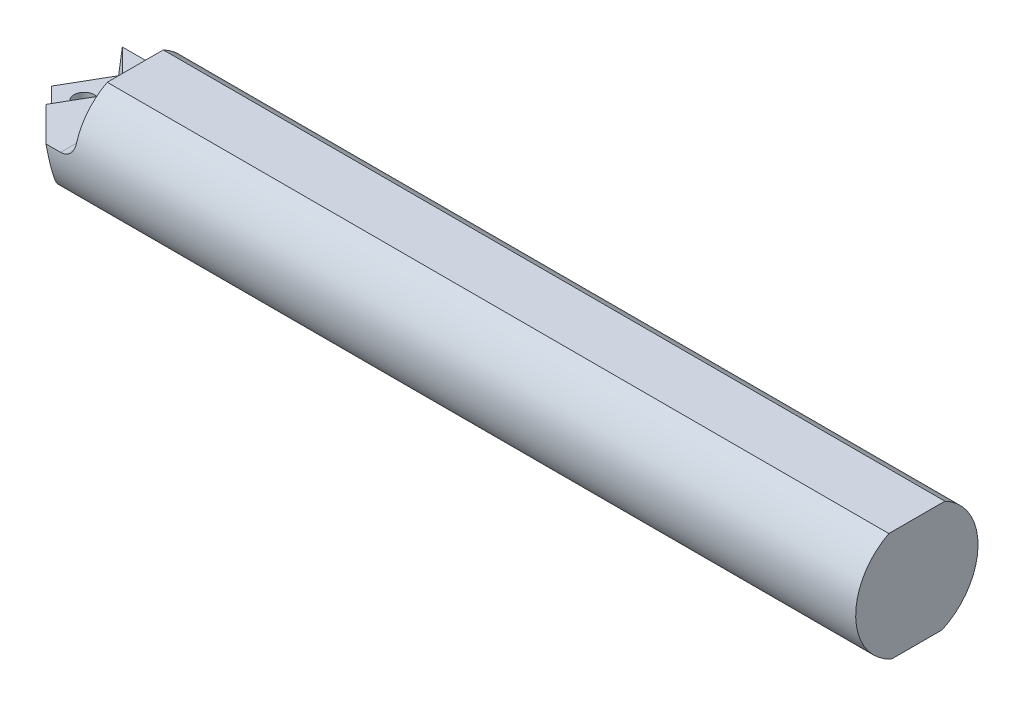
ISO-10303-21;
HEADER;
FILE_DESCRIPTION(('STEP AP214'),'2;1');
FILE_NAME('part.step','',(''),(''),'','','');
FILE_SCHEMA(('AUTOMOTIVE_DESIGN { 1 0 10303 214 1 1 1 1 }'));
ENDSEC;
DATA;
#1=APPLICATION_CONTEXT('core data for automotive mechanical design processes');
#2=APPLICATION_PROTOCOL_DEFINITION('international standard','automotive_design',2000,#1);
#3=PRODUCT_CONTEXT('',#1,'mechanical');
#4=PRODUCT('Part','Part','',(#3));
#5=PRODUCT_RELATED_PRODUCT_CATEGORY('part','',(#4));
#6=PRODUCT_DEFINITION_FORMATION('','',#4);
#7=PRODUCT_DEFINITION_CONTEXT('part definition',#1,'design');
#8=PRODUCT_DEFINITION('design','',#6,#7);
#9=PRODUCT_DEFINITION_SHAPE('','',#8);
#10=(LENGTH_UNIT() NAMED_UNIT(*) SI_UNIT(.MILLI.,.METRE.));
#11=(NAMED_UNIT(*) PLANE_ANGLE_UNIT() SI_UNIT($,.RADIAN.));
#12=(NAMED_UNIT(*) SI_UNIT($,.STERADIAN.) SOLID_ANGLE_UNIT());
#13=UNCERTAINTY_MEASURE_WITH_UNIT(LENGTH_MEASURE(1.E-05),#10,'distance_accuracy_value','');
#14=(GEOMETRIC_REPRESENTATION_CONTEXT(3) GLOBAL_UNCERTAINTY_ASSIGNED_CONTEXT((#13)) GLOBAL_UNIT_ASSIGNED_CONTEXT((#10,
#11,#12)) REPRESENTATION_CONTEXT('',''));
#15=CARTESIAN_POINT('',(0.,0.,0.));
#16=DIRECTION('',(0.,0.,1.));
#17=DIRECTION('',(1.,0.,0.));
#18=AXIS2_PLACEMENT_3D('',#15,#16,#17);
#19=CARTESIAN_POINT('',(65.,0.,0.));
#20=DIRECTION('',(-1.,0.,0.));
#21=DIRECTION('',(0.,0.,1.));
#22=AXIS2_PLACEMENT_3D('',#19,#20,#21);
#23=CYLINDRICAL_SURFACE('',#22,9.);
#24=CARTESIAN_POINT('',(-50.,0.,0.));
#25=DIRECTION('',(-1.,0.,0.));
#26=DIRECTION('',(0.,0.,1.));
#27=AXIS2_PLACEMENT_3D('',#24,#25,#26);
#28=CIRCLE('',#27,9.);
#29=CARTESIAN_POINT('',(-50.,2.5,8.64580823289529));
#30=VERTEX_POINT('',#29);
#31=CARTESIAN_POINT('',(-50.,8.,4.12310562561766));
#32=VERTEX_POINT('',#31);
#33=EDGE_CURVE('E171',#30,#32,#28,.T.);
#34=ORIENTED_EDGE('',*,*,#33,.F.);
#35=CARTESIAN_POINT('',(-50.,2.5,8.64580823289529));
#36=CARTESIAN_POINT('',(-50.000000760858,2.44518629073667,8.6616608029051));
#37=CARTESIAN_POINT('',(-50.0022551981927,2.39024129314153,8.67698015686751));
#38=CARTESIAN_POINT('',(-50.0113263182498,2.28041439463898,8.70648829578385));
#39=CARTESIAN_POINT('',(-50.0181438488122,2.22553250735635,8.7206768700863));
#40=CARTESIAN_POINT('',(-50.0455083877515,2.06158373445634,8.76142104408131));
#41=CARTESIAN_POINT('',(-50.0729671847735,1.95312970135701,8.78617930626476));
#42=CARTESIAN_POINT('',(-50.14610174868,1.74128217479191,8.83061157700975));
#43=CARTESIAN_POINT('',(-50.191807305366,1.63789726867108,8.85027718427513));
#44=CARTESIAN_POINT('',(-50.3004076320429,1.43974897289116,8.88466272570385));
#45=CARTESIAN_POINT('',(-50.3632909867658,1.34497991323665,8.89938592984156));
#46=CARTESIAN_POINT('',(-50.5028939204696,1.16921847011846,8.92416056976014));
#47=CARTESIAN_POINT('',(-50.5792563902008,1.08795621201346,8.93431300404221));
#48=CARTESIAN_POINT('',(-50.7446581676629,0.939071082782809,8.95118839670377));
#49=CARTESIAN_POINT('',(-50.833701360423,0.871452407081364,8.95791030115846));
#50=CARTESIAN_POINT('',(-51.0216293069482,0.752100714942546,8.96872003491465));
#51=CARTESIAN_POINT('',(-51.1204849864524,0.700322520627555,8.97281539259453));
#52=CARTESIAN_POINT('',(-51.3254535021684,0.61390851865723,8.97914262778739));
#53=CARTESIAN_POINT('',(-51.4315626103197,0.579263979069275,8.98137545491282));
#54=CARTESIAN_POINT('',(-51.6151426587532,0.535847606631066,8.98405199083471));
#55=CARTESIAN_POINT('',(-51.6915410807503,0.522415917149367,8.98483290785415));
#56=CARTESIAN_POINT('',(-51.8452830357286,0.504491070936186,8.9858505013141));
#57=CARTESIAN_POINT('',(-51.9226252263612,0.49998643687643,8.98608787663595));
#58=CARTESIAN_POINT('',(-52.,0.500000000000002,8.98610037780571));
#59=B_SPLINE_CURVE_WITH_KNOTS('',3,(#35,#36,#37,#38,#39,#40,#41,#42,#43,#44,#45,#46,#47,#48,#49,
#50,#51,#52,#53,#54,#55,#56,#57,#58),.UNSPECIFIED.,.F.,.F.,(4,2,2,2,2,2,2,2,2,2,2,4),(0.,
0.171085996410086,0.3422037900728,0.684180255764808,1.02671733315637,1.3690273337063,
1.70334953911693,2.03777439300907,2.37123636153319,2.70452821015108,2.93675687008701,
3.16868676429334),.UNSPECIFIED.);
#60=CARTESIAN_POINT('',(-52.,0.500000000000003,8.98610037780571));
#61=VERTEX_POINT('',#60);
#62=EDGE_CURVE('E53',#30,#61,#59,.T.);
#63=ORIENTED_EDGE('',*,*,#62,.T.);
#64=DIRECTION('',(-1.,0.,0.));
#65=VECTOR('',#64,1.);
#66=CARTESIAN_POINT('',(65.,0.500000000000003,8.98610037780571));
#67=LINE('',#66,#65);
#68=CARTESIAN_POINT('',(-54.1466084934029,0.500000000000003,8.98610037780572));
#69=VERTEX_POINT('',#68);
#70=EDGE_CURVE('E181',#61,#69,#67,.T.);
#71=ORIENTED_EDGE('',*,*,#70,.T.);
#72=CARTESIAN_POINT('',(-63.0080268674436,0.,0.));
#73=DIRECTION('',(0.696364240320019,0.173648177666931,-0.696364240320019));
#74=DIRECTION('',(-0.717688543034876,0.168488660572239,-0.675673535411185));
#75=AXIS2_PLACEMENT_3D('',#72,#73,#74);
#76=ELLIPSE('',#75,12.9242707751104,9.);
#77=CARTESIAN_POINT('',(-57.2537946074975,-8.2,3.70944739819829));
#78=VERTEX_POINT('',#77);
#79=EDGE_CURVE('E315',#69,#78,#76,.T.);
#80=ORIENTED_EDGE('',*,*,#79,.T.);
#81=DIRECTION('',(-1.,0.,0.));
#82=VECTOR('',#81,1.);
#83=CARTESIAN_POINT('',(65.,-8.2,3.70944739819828));
#84=LINE('',#83,#82);
#85=CARTESIAN_POINT('',(65.,-8.2,3.70944739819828));
#86=VERTEX_POINT('',#85);
#87=EDGE_CURVE('E312',#86,#78,#84,.T.);
#88=ORIENTED_EDGE('',*,*,#87,.F.);
#89=CARTESIAN_POINT('',(65.,0.,0.));
#90=DIRECTION('',(1.,0.,0.));
#91=DIRECTION('',(0.,0.,-1.));
#92=AXIS2_PLACEMENT_3D('',#89,#90,#91);
#93=CIRCLE('',#92,9.);
#94=CARTESIAN_POINT('',(65.,8.,4.12310562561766));
#95=VERTEX_POINT('',#94);
#96=EDGE_CURVE('E196',#95,#86,#93,.T.);
#97=ORIENTED_EDGE('',*,*,#96,.F.);
#98=DIRECTION('',(-1.,0.,0.));
#99=VECTOR('',#98,1.);
#100=CARTESIAN_POINT('',(65.,8.,4.12310562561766));
#101=LINE('',#100,#99);
#102=EDGE_CURVE('E188',#32,#95,#101,.F.);
#103=ORIENTED_EDGE('',*,*,#102,.F.);
#104=EDGE_LOOP('',(#34,#63,#71,#80,#88,#97,#103));
#105=FACE_BOUND('',#104,.T.);
#106=ADVANCED_FACE('F39',(#105),#23,.T.);
#107=DIRECTION('',(-1.,0.,0.));
#108=VECTOR('',#107,1.);
#109=CARTESIAN_POINT('',(65.,-8.2,-3.70944739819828));
#110=LINE('',#109,#108);
#111=CARTESIAN_POINT('',(-62.1650683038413,-8.2,-3.70944739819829));
#112=VERTEX_POINT('',#111);
#113=CARTESIAN_POINT('',(-60.9532266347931,-8.2,-3.70944739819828));
#114=VERTEX_POINT('',#113);
#115=EDGE_CURVE('E350',#112,#114,#110,.F.);
#116=ORIENTED_EDGE('',*,*,#115,.F.);
#117=CARTESIAN_POINT('',(-65.9762786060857,0.,0.));
#118=DIRECTION('',(0.852868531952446,0.173648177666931,0.492403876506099));
#119=DIRECTION('',(-0.522125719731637,0.283646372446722,0.804319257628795));
#120=AXIS2_PLACEMENT_3D('',#117,#118,#119);
#121=ELLIPSE('',#120,10.5526228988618,9.);
#122=CARTESIAN_POINT('',(-60.889953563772,0.5,-8.98610037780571));
#123=VERTEX_POINT('',#122);
#124=EDGE_CURVE('E307',#112,#123,#121,.T.);
#125=ORIENTED_EDGE('',*,*,#124,.T.);
#126=DIRECTION('',(-1.,0.,0.));
#127=VECTOR('',#126,1.);
#128=CARTESIAN_POINT('',(65.,0.5,-8.98610037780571));
#129=LINE('',#128,#127);
#130=CARTESIAN_POINT('',(-52.,0.5,-8.98610037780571));
#131=VERTEX_POINT('',#130);
#132=EDGE_CURVE('E178',#123,#131,#129,.F.);
#133=ORIENTED_EDGE('',*,*,#132,.T.);
#134=CARTESIAN_POINT('',(-52.,0.5,-8.98610037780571));
#135=CARTESIAN_POINT('',(-51.9438964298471,0.500000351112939,-8.98609734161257));
#136=CARTESIAN_POINT('',(-51.8878196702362,0.502362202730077,-8.9859692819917));
#137=CARTESIAN_POINT('',(-51.7760658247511,0.511784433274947,-8.98543874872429));
#138=CARTESIAN_POINT('',(-51.7203887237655,0.518844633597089,-8.98503628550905));
#139=CARTESIAN_POINT('',(-51.5546359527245,0.547008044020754,-8.98338238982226));
#140=CARTESIAN_POINT('',(-51.4456679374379,0.575094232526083,-8.98168458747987));
#141=CARTESIAN_POINT('',(-51.2339988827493,0.649098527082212,-8.97663805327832));
#142=CARTESIAN_POINT('',(-51.1313012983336,0.695026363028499,-8.97328842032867));
#143=CARTESIAN_POINT('',(-50.9351205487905,0.803363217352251,-8.9642372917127));
#144=CARTESIAN_POINT('',(-50.841635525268,0.86576890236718,-8.95853627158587));
#145=CARTESIAN_POINT('',(-50.6668244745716,1.00497742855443,-8.94398612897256));
#146=CARTESIAN_POINT('',(-50.5854628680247,1.08173658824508,-8.93514648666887));
#147=CARTESIAN_POINT('',(-50.43686305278,1.24741016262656,-8.91352504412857));
#148=CARTESIAN_POINT('',(-50.369624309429,1.3363241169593,-8.90074339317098));
#149=CARTESIAN_POINT('',(-50.2514391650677,1.52293107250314,-8.87071294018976));
#150=CARTESIAN_POINT('',(-50.200397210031,1.62056805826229,-8.85349146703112));
#151=CARTESIAN_POINT('',(-50.1152285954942,1.82206660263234,-8.8142267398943));
#152=CARTESIAN_POINT('',(-50.0811014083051,1.92592796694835,-8.79218363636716));
#153=CARTESIAN_POINT('',(-50.0370562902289,2.10860627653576,-8.74986183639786));
#154=CARTESIAN_POINT('',(-50.0231136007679,2.18673722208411,-8.73067315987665));
#155=CARTESIAN_POINT('',(-50.0045846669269,2.34334903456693,-8.68995593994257));
#156=CARTESIAN_POINT('',(-49.9999817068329,2.42182902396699,-8.66843164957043));
#157=CARTESIAN_POINT('',(-50.,2.5,-8.64580823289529));
#158=B_SPLINE_CURVE_WITH_KNOTS('',3,(#134,#135,#136,#137,#138,#139,#140,#141,#142,#143,#144,
#145,#146,#147,#148,#149,#150,#151,#152,#153,#154,#155,#156,#157),.UNSPECIFIED.,.F.,.F.,(4,2,2,
2,2,2,2,2,2,2,2,4),(0.,0.168207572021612,0.336408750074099,0.672304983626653,1.00838465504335,
1.3443963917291,1.67940172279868,2.01439436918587,2.34737228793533,2.68033981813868,
2.92474900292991,3.16872037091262),.UNSPECIFIED.);
#159=CARTESIAN_POINT('',(-50.,2.5,-8.64580823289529));
#160=VERTEX_POINT('',#159);
#161=EDGE_CURVE('E12',#131,#160,#158,.T.);
#162=ORIENTED_EDGE('',*,*,#161,.T.);
#163=CARTESIAN_POINT('',(-50.,8.,-4.12310562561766));
#164=VERTEX_POINT('',#163);
#165=EDGE_CURVE('E166',#164,#160,#28,.T.);
#166=ORIENTED_EDGE('',*,*,#165,.F.);
#167=DIRECTION('',(-1.,0.,0.));
#168=VECTOR('',#167,1.);
#169=CARTESIAN_POINT('',(65.,8.,-4.12310562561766));
#170=LINE('',#169,#168);
#171=CARTESIAN_POINT('',(65.,8.,-4.12310562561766));
#172=VERTEX_POINT('',#171);
#173=EDGE_CURVE('E191',#172,#164,#170,.T.);
#174=ORIENTED_EDGE('',*,*,#173,.F.);
#175=CARTESIAN_POINT('',(65.,-8.2,-3.70944739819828));
#176=VERTEX_POINT('',#175);
#177=EDGE_CURVE('E195',#176,#172,#93,.T.);
#178=ORIENTED_EDGE('',*,*,#177,.F.);
#179=CARTESIAN_POINT('',(-59.124243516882,-8.2,-3.70944739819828));
#180=VERTEX_POINT('',#179);
#181=EDGE_CURVE('E353',#180,#176,#110,.F.);
#182=ORIENTED_EDGE('',*,*,#181,.F.);
#183=CARTESIAN_POINT('',(-59.124243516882,-8.2,-3.70944739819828));
#184=CARTESIAN_POINT('',(-59.1552428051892,-8.18921526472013,-3.73328794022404));
#185=CARTESIAN_POINT('',(-59.1872487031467,-8.17882663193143,-3.75597581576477));
#186=CARTESIAN_POINT('',(-59.2531581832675,-8.15897863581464,-3.79889804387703));
#187=CARTESIAN_POINT('',(-59.2870625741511,-8.14951967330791,-3.81913133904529));
#188=CARTESIAN_POINT('',(-59.3915200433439,-8.12272798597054,-3.87595811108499));
#189=CARTESIAN_POINT('',(-59.4647173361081,-8.10701590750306,-3.90860110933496));
#190=CARTESIAN_POINT('',(-59.6164706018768,-8.08103268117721,-3.96204581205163));
#191=CARTESIAN_POINT('',(-59.695041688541,-8.07077765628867,-3.98281244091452));
#192=CARTESIAN_POINT('',(-59.8549570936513,-8.0566274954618,-4.01136062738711));
#193=CARTESIAN_POINT('',(-59.9362962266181,-8.05272107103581,-4.0191652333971));
#194=CARTESIAN_POINT('',(-60.0946850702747,-8.05161181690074,-4.02138591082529));
#195=CARTESIAN_POINT('',(-60.1717234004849,-8.05405043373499,-4.01651808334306));
#196=CARTESIAN_POINT('',(-60.3238101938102,-8.06468686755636,-3.99511769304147));
#197=CARTESIAN_POINT('',(-60.3988569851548,-8.0728893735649,-3.97857563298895));
#198=CARTESIAN_POINT('',(-60.5442281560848,-8.09434522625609,-3.93473755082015));
#199=CARTESIAN_POINT('',(-60.6145874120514,-8.10755480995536,-3.9075346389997));
#200=CARTESIAN_POINT('',(-60.7496211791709,-8.1381473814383,-3.8434111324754));
#201=CARTESIAN_POINT('',(-60.8143032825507,-8.15552467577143,-3.80650378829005));
#202=CARTESIAN_POINT('',(-60.9021089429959,-8.18270784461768,-3.74748964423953));
#203=CARTESIAN_POINT('',(-60.9280156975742,-8.19122548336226,-3.72884425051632));
#204=CARTESIAN_POINT('',(-60.9532266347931,-8.2,-3.70944739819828));
#205=B_SPLINE_CURVE_WITH_KNOTS('',3,(#183,#184,#185,#186,#187,#188,#189,#190,#191,#192,#193,
#194,#195,#196,#197,#198,#199,#200,#201,#202,#203,#204),.UNSPECIFIED.,.F.,.F.,(4,2,2,2,2,2,2,2,
2,2,4),(0.,0.121638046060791,0.243328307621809,0.487098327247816,0.731584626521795,
0.975635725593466,1.20619893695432,1.43694993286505,1.66572895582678,1.89419720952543,
1.9932252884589),.UNSPECIFIED.);
#206=EDGE_CURVE('E230',#180,#114,#205,.T.);
#207=ORIENTED_EDGE('',*,*,#206,.T.);
#208=EDGE_LOOP('',(#116,#125,#133,#162,#166,#174,#178,#182,#207));
#209=FACE_BOUND('',#208,.T.);
#210=ADVANCED_FACE('F224',(#209),#23,.T.);
#211=CARTESIAN_POINT('',(65.,0.,0.));
#212=DIRECTION('',(1.,0.,0.));
#213=DIRECTION('',(0.,0.,-1.));
#214=AXIS2_PLACEMENT_3D('',#211,#212,#213);
#215=PLANE('',#214);
#216=ORIENTED_EDGE('',*,*,#96,.T.);
#217=DIRECTION('',(0.,0.,-1.));
#218=VECTOR('',#217,1.);
#219=CARTESIAN_POINT('',(65.,-8.2,-9.));
#220=LINE('',#219,#218);
#221=EDGE_CURVE('E240',#86,#176,#220,.T.);
#222=ORIENTED_EDGE('',*,*,#221,.T.);
#223=ORIENTED_EDGE('',*,*,#177,.T.);
#224=DIRECTION('',(0.,0.,-1.));
#225=VECTOR('',#224,1.);
#226=CARTESIAN_POINT('',(65.,8.,-9.));
#227=LINE('',#226,#225);
#228=EDGE_CURVE('E184',#95,#172,#227,.T.);
#229=ORIENTED_EDGE('',*,*,#228,.F.);
#230=EDGE_LOOP('',(#216,#222,#223,#229));
#231=FACE_BOUND('',#230,.T.);
#232=ADVANCED_FACE('F225',(#231),#215,.T.);
#233=CARTESIAN_POINT('',(0.,8.,0.));
#234=DIRECTION('',(0.,1.,0.));
#235=DIRECTION('',(0.,0.,1.));
#236=AXIS2_PLACEMENT_3D('',#233,#234,#235);
#237=PLANE('',#236);
#238=ORIENTED_EDGE('',*,*,#173,.T.);
#239=DIRECTION('',(0.,0.,1.));
#240=VECTOR('',#239,1.);
#241=CARTESIAN_POINT('',(-50.,8.,0.));
#242=LINE('',#241,#240);
#243=EDGE_CURVE('E200',#164,#32,#242,.T.);
#244=ORIENTED_EDGE('',*,*,#243,.T.);
#245=ORIENTED_EDGE('',*,*,#102,.T.);
#246=ORIENTED_EDGE('',*,*,#228,.T.);
#247=EDGE_LOOP('',(#238,#244,#245,#246));
#248=FACE_BOUND('',#247,.T.);
#249=ADVANCED_FACE('F270',(#248),#237,.T.);
#250=CARTESIAN_POINT('',(-50.,0.5,-9.));
#251=DIRECTION('',(0.,-1.,0.));
#252=DIRECTION('',(0.,0.,-1.));
#253=AXIS2_PLACEMENT_3D('',#250,#251,#252);
#254=PLANE('',#253);
#255=DIRECTION('',(-0.707106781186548,0.,-0.707106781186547));
#256=VECTOR('',#255,1.);
#257=CARTESIAN_POINT('',(-55.0774701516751,0.500000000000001,-3.17361696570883));
#258=LINE('',#257,#256);
#259=CARTESIAN_POINT('',(-56.1381303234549,0.500000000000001,-4.23427713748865));
#260=VERTEX_POINT('',#259);
#261=EDGE_CURVE('E173',#260,#123,#258,.T.);
#262=ORIENTED_EDGE('',*,*,#261,.F.);
#263=CARTESIAN_POINT('',(-55.0774701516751,0.500000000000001,-3.17361696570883));
#264=DIRECTION('',(0.,1.,0.));
#265=DIRECTION('',(0.,0.,1.));
#266=AXIS2_PLACEMENT_3D('',#263,#264,#265);
#267=CIRCLE('',#266,1.5);
#268=CARTESIAN_POINT('',(-55.8274701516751,0.500000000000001,-1.87457886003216));
#269=VERTEX_POINT('',#268);
#270=EDGE_CURVE('E141',#269,#260,#267,.T.);
#271=ORIENTED_EDGE('',*,*,#270,.F.);
#272=DIRECTION('',(0.499999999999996,0.,-0.866025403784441));
#273=VECTOR('',#272,1.);
#274=CARTESIAN_POINT('',(-59.1875165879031,0.500000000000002,3.94519228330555));
#275=LINE('',#274,#273);
#276=CARTESIAN_POINT('',(-59.1875165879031,0.500000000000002,3.94519228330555));
#277=VERTEX_POINT('',#276);
#278=EDGE_CURVE('E346',#277,#269,#275,.T.);
#279=ORIENTED_EDGE('',*,*,#278,.F.);
#280=DIRECTION('',(-0.707106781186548,0.,-0.707106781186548));
#281=VECTOR('',#280,1.);
#282=CARTESIAN_POINT('',(-31.5663544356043,0.500000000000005,31.5663544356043));
#283=LINE('',#282,#281);
#284=EDGE_CURVE('E336',#69,#277,#283,.T.);
#285=ORIENTED_EDGE('',*,*,#284,.F.);
#286=ORIENTED_EDGE('',*,*,#70,.F.);
#287=DIRECTION('',(0.,0.,1.));
#288=VECTOR('',#287,1.);
#289=CARTESIAN_POINT('',(-52.,0.5,-9.));
#290=LINE('',#289,#288);
#291=EDGE_CURVE('E60',#61,#131,#290,.F.);
#292=ORIENTED_EDGE('',*,*,#291,.T.);
#293=ORIENTED_EDGE('',*,*,#132,.F.);
#294=EDGE_LOOP('',(#262,#271,#279,#285,#286,#292,#293));
#295=FACE_BOUND('',#294,.T.);
#296=ADVANCED_FACE('F267',(#295),#254,.F.);
#297=CARTESIAN_POINT('',(-50.,0.,0.));
#298=DIRECTION('',(-1.,0.,0.));
#299=DIRECTION('',(0.,0.,1.));
#300=AXIS2_PLACEMENT_3D('',#297,#298,#299);
#301=PLANE('',#300);
#302=ORIENTED_EDGE('',*,*,#165,.T.);
#303=DIRECTION('',(0.,0.,1.));
#304=VECTOR('',#303,1.);
#305=CARTESIAN_POINT('',(-50.,2.5,0.));
#306=LINE('',#305,#304);
#307=EDGE_CURVE('E211',#160,#30,#306,.T.);
#308=ORIENTED_EDGE('',*,*,#307,.T.);
#309=ORIENTED_EDGE('',*,*,#33,.T.);
#310=ORIENTED_EDGE('',*,*,#243,.F.);
#311=EDGE_LOOP('',(#302,#308,#309,#310));
#312=FACE_BOUND('',#311,.T.);
#313=ADVANCED_FACE('F264',(#312),#301,.T.);
#314=CARTESIAN_POINT('',(-55.0774701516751,0.500000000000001,-3.17361696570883));
#315=DIRECTION('',(0.701836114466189,-0.121869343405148,-0.701836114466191));
#316=DIRECTION('',(-0.707106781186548,0.,-0.707106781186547));
#317=AXIS2_PLACEMENT_3D('',#314,#315,#316);
#318=PLANE('',#317);
#319=DIRECTION('',(-0.707106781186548,0.,-0.707106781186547));
#320=VECTOR('',#319,1.);
#321=CARTESIAN_POINT('',(-26.2280199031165,-2.68,26.2280199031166));
#322=LINE('',#321,#320);
#323=CARTESIAN_POINT('',(-56.3776593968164,-2.68,-3.92161959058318));
#324=VERTEX_POINT('',#323);
#325=CARTESIAN_POINT('',(-60.6815925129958,-2.68,-8.22555270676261));
#326=VERTEX_POINT('',#325);
#327=EDGE_CURVE('E154',#324,#326,#322,.T.);
#328=ORIENTED_EDGE('',*,*,#327,.F.);
#329=CARTESIAN_POINT('',(-55.0774701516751,0.500000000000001,-3.17361696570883));
#330=DIRECTION('',(0.701836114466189,-0.121869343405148,-0.701836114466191));
#331=DIRECTION('',(0.0861746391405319,0.992546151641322,-0.0861746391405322));
#332=AXIS2_PLACEMENT_3D('',#329,#330,#331);
#333=ELLIPSE('',#332,12.3082635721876,1.5);
#334=EDGE_CURVE('E135',#324,#260,#333,.T.);
#335=ORIENTED_EDGE('',*,*,#334,.T.);
#336=ORIENTED_EDGE('',*,*,#261,.T.);
#337=DIRECTION('',(0.0635961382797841,-0.970602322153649,0.232135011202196));
#338=VECTOR('',#337,1.);
#339=CARTESIAN_POINT('',(-60.7806361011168,-1.16839977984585,-8.58707598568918));
#340=LINE('',#339,#338);
#341=EDGE_CURVE('E164',#123,#326,#340,.T.);
#342=ORIENTED_EDGE('',*,*,#341,.T.);
#343=EDGE_LOOP('',(#328,#335,#336,#342));
#344=FACE_BOUND('',#343,.T.);
#345=ADVANCED_FACE('F162',(#344),#318,.F.);
#346=CARTESIAN_POINT('',(-59.1875165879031,0.500000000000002,3.94519228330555));
#347=DIRECTION('',(0.859570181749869,-0.121869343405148,0.496273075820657));
#348=DIRECTION('',(0.499999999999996,0.,-0.866025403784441));
#349=AXIS2_PLACEMENT_3D('',#346,#347,#348);
#350=PLANE('',#349);
#351=ORIENTED_EDGE('',*,*,#278,.T.);
#352=CARTESIAN_POINT('',(-55.0774701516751,0.499999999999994,-3.17361696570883));
#353=DIRECTION('',(0.859570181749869,-0.121869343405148,0.496273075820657));
#354=DIRECTION('',(0.105541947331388,0.992546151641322,0.0609346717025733));
#355=AXIS2_PLACEMENT_3D('',#352,#353,#354);
#356=ELLIPSE('',#355,12.3082635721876,1.5);
#357=CARTESIAN_POINT('',(-56.1397591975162,-2.68,-2.11458817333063));
#358=VERTEX_POINT('',#357);
#359=EDGE_CURVE('E147',#269,#358,#356,.T.);
#360=ORIENTED_EDGE('',*,*,#359,.T.);
#361=DIRECTION('',(0.499999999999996,0.,-0.866025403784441));
#362=VECTOR('',#361,1.);
#363=CARTESIAN_POINT('',(-43.0204629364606,-2.68,-24.8378758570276));
#364=LINE('',#363,#362);
#365=CARTESIAN_POINT('',(-59.18309948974,-2.68,3.15663183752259));
#366=VERTEX_POINT('',#365);
#367=EDGE_CURVE('E158',#366,#358,#364,.T.);
#368=ORIENTED_EDGE('',*,*,#367,.F.);
#369=DIRECTION('',(-0.00134819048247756,0.970602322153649,0.240685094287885));
#370=VECTOR('',#369,1.);
#371=CARTESIAN_POINT('',(-59.1875165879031,0.500000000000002,3.94519228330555));
#372=LINE('',#371,#370);
#373=EDGE_CURVE('E319',#366,#277,#372,.T.);
#374=ORIENTED_EDGE('',*,*,#373,.T.);
#375=EDGE_LOOP('',(#351,#360,#368,#374));
#376=FACE_BOUND('',#375,.T.);
#377=ADVANCED_FACE('F258',(#376),#350,.F.);
#378=CARTESIAN_POINT('',(0.,-2.68,0.));
#379=DIRECTION('',(0.,1.,0.));
#380=DIRECTION('',(0.,0.,1.));
#381=AXIS2_PLACEMENT_3D('',#378,#379,#380);
#382=PLANE('',#381);
#383=CARTESIAN_POINT('',(-55.0774701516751,-2.68,-3.17361696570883));
#384=DIRECTION('',(0.,1.,0.));
#385=DIRECTION('',(0.,0.,1.));
#386=AXIS2_PLACEMENT_3D('',#383,#384,#385);
#387=CIRCLE('',#386,1.5);
#388=EDGE_CURVE('E138',#358,#324,#387,.T.);
#389=ORIENTED_EDGE('',*,*,#388,.T.);
#390=ORIENTED_EDGE('',*,*,#327,.T.);
#391=DIRECTION('',(0.499999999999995,0.,-0.866025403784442));
#392=VECTOR('',#391,1.);
#393=CARTESIAN_POINT('',(-49.0729631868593,-2.68,-28.3322885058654));
#394=LINE('',#393,#392);
#395=CARTESIAN_POINT('',(-64.2992746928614,-2.68,-1.95954336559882));
#396=VERTEX_POINT('',#395);
#397=EDGE_CURVE('E333',#396,#326,#394,.T.);
#398=ORIENTED_EDGE('',*,*,#397,.F.);
#399=DIRECTION('',(-0.707106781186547,0.,-0.707106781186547));
#400=VECTOR('',#399,1.);
#401=CARTESIAN_POINT('',(-31.1698656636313,-2.68,31.1698656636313));
#402=LINE('',#401,#400);
#403=EDGE_CURVE('E324',#366,#396,#402,.T.);
#404=ORIENTED_EDGE('',*,*,#403,.F.);
#405=ORIENTED_EDGE('',*,*,#367,.T.);
#406=EDGE_LOOP('',(#389,#390,#398,#404,#405));
#407=FACE_BOUND('',#406,.T.);
#408=CARTESIAN_POINT('',(-60.0387350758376,-2.68,-2.52045404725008));
#409=DIRECTION('',(0.,1.,0.));
#410=DIRECTION('',(0.,0.,1.));
#411=AXIS2_PLACEMENT_3D('',#408,#409,#410);
#412=CIRCLE('',#411,1.5);
#413=CARTESIAN_POINT('',(-60.0387350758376,-2.68,-1.02045404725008));
#414=VERTEX_POINT('',#413);
#415=EDGE_CURVE('E241',#414,#414,#412,.T.);
#416=ORIENTED_EDGE('',*,*,#415,.F.);
#417=EDGE_LOOP('',(#416));
#418=FACE_BOUND('',#417,.T.);
#419=ADVANCED_FACE('F151',(#407,#418),#382,.T.);
#420=CARTESIAN_POINT('',(0.,-8.2,0.));
#421=DIRECTION('',(0.,-1.,0.));
#422=DIRECTION('',(0.,0.,-1.));
#423=AXIS2_PLACEMENT_3D('',#420,#421,#422);
#424=PLANE('',#423);
#425=DIRECTION('',(0.707106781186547,0.,0.707106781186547));
#426=VECTOR('',#425,1.);
#427=CARTESIAN_POINT('',(-30.4816210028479,-8.2,30.4816210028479));
#428=LINE('',#427,#426);
#429=CARTESIAN_POINT('',(-63.0829213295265,-8.2,-2.11967932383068));
#430=VERTEX_POINT('',#429);
#431=EDGE_CURVE('E208',#430,#78,#428,.T.);
#432=ORIENTED_EDGE('',*,*,#431,.F.);
#433=DIRECTION('',(0.499999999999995,0.,-0.866025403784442));
#434=VECTOR('',#433,1.);
#435=CARTESIAN_POINT('',(-48.2300390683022,-8.2,-27.8456260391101));
#436=LINE('',#435,#434);
#437=EDGE_CURVE('E146',#430,#112,#436,.T.);
#438=ORIENTED_EDGE('',*,*,#437,.T.);
#439=ORIENTED_EDGE('',*,*,#115,.T.);
#440=CARTESIAN_POINT('',(-60.0387350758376,-8.2,-2.52045404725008));
#441=DIRECTION('',(0.,-1.,0.));
#442=DIRECTION('',(0.,0.,-1.));
#443=AXIS2_PLACEMENT_3D('',#440,#441,#442);
#444=CIRCLE('',#443,1.5);
#445=EDGE_CURVE('E204',#180,#114,#444,.T.);
#446=ORIENTED_EDGE('',*,*,#445,.F.);
#447=ORIENTED_EDGE('',*,*,#181,.T.);
#448=ORIENTED_EDGE('',*,*,#221,.F.);
#449=ORIENTED_EDGE('',*,*,#87,.T.);
#450=EDGE_LOOP('',(#432,#438,#439,#446,#447,#448,#449));
#451=FACE_BOUND('',#450,.T.);
#452=ADVANCED_FACE('F250',(#451),#424,.T.);
#453=CARTESIAN_POINT('',(-60.0387350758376,-8.2,-2.52045404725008));
#454=DIRECTION('',(0.,1.,0.));
#455=DIRECTION('',(0.,0.,1.));
#456=AXIS2_PLACEMENT_3D('',#453,#454,#455);
#457=CYLINDRICAL_SURFACE('',#456,1.5);
#458=ORIENTED_EDGE('',*,*,#415,.T.);
#459=EDGE_LOOP('',(#458));
#460=FACE_BOUND('',#459,.T.);
#461=ORIENTED_EDGE('',*,*,#445,.T.);
#462=ORIENTED_EDGE('',*,*,#206,.F.);
#463=EDGE_LOOP('',(#461,#462));
#464=FACE_BOUND('',#463,.T.);
#465=ADVANCED_FACE('F244',(#460,#464),#457,.F.);
#466=CARTESIAN_POINT('',(-31.5663544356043,0.500000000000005,31.5663544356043));
#467=DIRECTION('',(0.696364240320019,0.173648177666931,-0.696364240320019));
#468=DIRECTION('',(-0.707106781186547,0.,-0.707106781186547));
#469=AXIS2_PLACEMENT_3D('',#466,#467,#468);
#470=PLANE('',#469);
#471=ORIENTED_EDGE('',*,*,#284,.T.);
#472=ORIENTED_EDGE('',*,*,#373,.F.);
#473=ORIENTED_EDGE('',*,*,#403,.T.);
#474=DIRECTION('',(0.215105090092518,-0.976180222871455,-0.0283191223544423));
#475=VECTOR('',#474,1.);
#476=CARTESIAN_POINT('',(-63.6566825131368,-5.59618286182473,-2.04414223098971));
#477=LINE('',#476,#475);
#478=EDGE_CURVE('E305',#396,#430,#477,.T.);
#479=ORIENTED_EDGE('',*,*,#478,.T.);
#480=ORIENTED_EDGE('',*,*,#431,.T.);
#481=ORIENTED_EDGE('',*,*,#79,.F.);
#482=EDGE_LOOP('',(#471,#472,#473,#479,#480,#481));
#483=FACE_BOUND('',#482,.T.);
#484=ADVANCED_FACE('F249',(#483),#470,.F.);
#485=CARTESIAN_POINT('',(-49.5585607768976,0.499999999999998,-28.6126484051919));
#486=DIRECTION('',(0.852868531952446,0.173648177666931,0.492403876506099));
#487=DIRECTION('',(0.499999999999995,0.,-0.866025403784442));
#488=AXIS2_PLACEMENT_3D('',#485,#486,#487);
#489=PLANE('',#488);
#490=ORIENTED_EDGE('',*,*,#437,.F.);
#491=ORIENTED_EDGE('',*,*,#478,.F.);
#492=ORIENTED_EDGE('',*,*,#397,.T.);
#493=ORIENTED_EDGE('',*,*,#341,.F.);
#494=ORIENTED_EDGE('',*,*,#124,.F.);
#495=EDGE_LOOP('',(#490,#491,#492,#493,#494));
#496=FACE_BOUND('',#495,.T.);
#497=ADVANCED_FACE('F290',(#496),#489,.F.);
#498=CARTESIAN_POINT('',(-52.,2.5,0.));
#499=DIRECTION('',(0.,0.,1.));
#500=DIRECTION('',(0.,-1.,0.));
#501=AXIS2_PLACEMENT_3D('',#498,#499,#500);
#502=CYLINDRICAL_SURFACE('',#501,2.);
#503=ORIENTED_EDGE('',*,*,#161,.F.);
#504=ORIENTED_EDGE('',*,*,#291,.F.);
#505=ORIENTED_EDGE('',*,*,#62,.F.);
#506=ORIENTED_EDGE('',*,*,#307,.F.);
#507=EDGE_LOOP('',(#503,#504,#505,#506));
#508=FACE_BOUND('',#507,.T.);
#509=ADVANCED_FACE('F41',(#508),#502,.F.);
#510=CARTESIAN_POINT('',(-55.0774701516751,-2.68,-3.17361696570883));
#511=DIRECTION('',(0.,1.,0.));
#512=DIRECTION('',(0.,0.,1.));
#513=AXIS2_PLACEMENT_3D('',#510,#511,#512);
#514=CYLINDRICAL_SURFACE('',#513,1.5);
#515=ORIENTED_EDGE('',*,*,#388,.F.);
#516=ORIENTED_EDGE('',*,*,#359,.F.);
#517=ORIENTED_EDGE('',*,*,#270,.T.);
#518=ORIENTED_EDGE('',*,*,#334,.F.);
#519=EDGE_LOOP('',(#515,#516,#517,#518));
#520=FACE_BOUND('',#519,.T.);
#521=ADVANCED_FACE('F137',(#520),#514,.F.);
#522=CLOSED_SHELL('',(#106,#210,#232,#249,#296,#313,#345,#377,#419,#452,#465,#484,#497,#509,#521));
#523=MANIFOLD_SOLID_BREP('B2',#522);
#524=ADVANCED_BREP_SHAPE_REPRESENTATION('',(#18,#523),#14);
#525=SHAPE_DEFINITION_REPRESENTATION(#9,#524);
ENDSEC;
END-ISO-10303-21;
